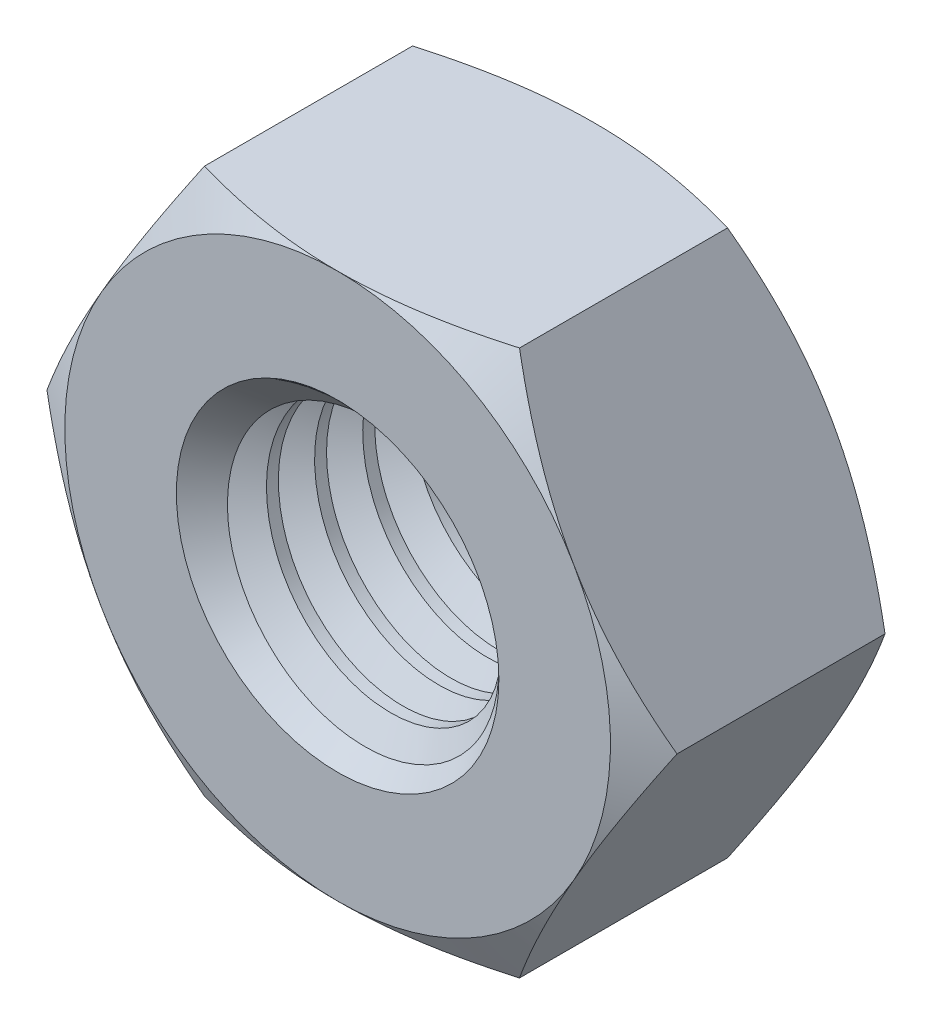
from build123d import *

# Parameters (mm, degrees)
Y_KSEKLIK_EKSTR_ZYON1_DEPTH = 8
IZIM2_OUTSIDE_W             = 54.778
IZIM2_OUTSIDE_H             = 52.148
IZIM2_OUTSIDE_R             = 8.5
KES_EKSTR_ZYON1_DEPTH       = 8
KES_EKSTR_ZYON1_DRAFT       = -60
IZIM3_OUTSIDE_W             = 54.778
IZIM3_OUTSIDE_H             = 52.148
IZIM3_OUTSIDE_R             = 8.5
KES_EKSTR_ZYON2_DEPTH       = 8
KES_EKSTR_ZYON2_DRAFT       = -60
IZIM4_R                     = 4.025
KES_EKSTR_ZYON3_DEPTH       = 28
PAH1_SIZE                   = 1
KES_S_P_R1_PITCH            = 1.5
KES_S_P_R1_HEIGHT           = 10
KES_S_P_R1_RADIUS           = 4.025


with BuildPart() as part:
    # izim1 → Y_kseklik-Ekstr_zyon1 (new body)
    with BuildSketch(Plane.XY):
        Polygon((9.814954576, 0), (4.907477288, 8.5), (-4.907477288, 8.5), (-9.814954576, 0), (-4.907477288, -8.5), (4.907477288, -8.5), align=None)
    extrude(amount=Y_KSEKLIK_EKSTR_ZYON1_DEPTH)


with BuildPart() as kes_ekstr_zyon1_tool:
    # izim2 outside → Kes-Ekstr_zyon1 (with draft: the straight prism first)
    with BuildSketch(Plane.XY.offset(8)):
        Rectangle(IZIM2_OUTSIDE_W, IZIM2_OUTSIDE_H)
        Circle(IZIM2_OUTSIDE_R, mode=Mode.SUBTRACT)
    extrude(amount=-KES_EKSTR_ZYON1_DEPTH)
    # Kes-Ekstr_zyon1: the draft: its side faces are tilted about the plane it starts from
    kes_ekstr_zyon1_sides = [kes_ekstr_zyon1_tool.faces().sort_by_distance(p)[0] for p in [
        (0, -26.074, 4),
        (27.389, 0, 4),
        (0, 26.074, 4),
        (-27.389, 0, 4),
        (-8.5, 0, 4),
    ]]
    draft(kes_ekstr_zyon1_sides, Plane.XY.offset(8), KES_EKSTR_ZYON1_DRAFT)


with BuildPart() as part_1:
    add(part.part)

    # Kes-Ekstr_zyon1: cut by kes_ekstr_zyon1_tool
    add(kes_ekstr_zyon1_tool.part, mode=Mode.SUBTRACT)


with BuildPart() as kes_ekstr_zyon2_tool:
    # izim3 outside → Kes-Ekstr_zyon2 (with draft: the straight prism first)
    with BuildSketch(Plane(origin=(0, 0, 0), x_dir=(-1, 0, 0), z_dir=(0, 0, -1))):
        Rectangle(IZIM3_OUTSIDE_W, IZIM3_OUTSIDE_H)
        Circle(IZIM3_OUTSIDE_R, mode=Mode.SUBTRACT)
    extrude(amount=-KES_EKSTR_ZYON2_DEPTH)
    # Kes-Ekstr_zyon2: the draft: its side faces are tilted about the plane it starts from
    kes_ekstr_zyon2_sides = [kes_ekstr_zyon2_tool.faces().sort_by_distance(p)[0] for p in [
        (0, -26.074, 4),
        (-27.389, 0, 4),
        (0, 26.074, 4),
        (27.389, 0, 4),
        (8.5, 0, 4),
    ]]
    draft(kes_ekstr_zyon2_sides, Plane(origin=(0, 0, 0), x_dir=(-1, 0, 0), z_dir=(0, 0, -1)), KES_EKSTR_ZYON2_DRAFT)


with BuildPart() as part_2:
    add(part_1.part)

    # Kes-Ekstr_zyon2: cut by kes_ekstr_zyon2_tool
    add(kes_ekstr_zyon2_tool.part, mode=Mode.SUBTRACT)

    # izim4 → Kes-Ekstr_zyon3 (cut)
    with BuildSketch(Plane(origin=(0, 0, 0), x_dir=(-1, 0, 0), z_dir=(0, 0, -1))):
        Circle(IZIM4_R)
    extrude(amount=-KES_EKSTR_ZYON3_DEPTH, mode=Mode.SUBTRACT)

    # Pah1
    pah1_edges = [part_2.edges().sort_by_distance(p)[0] for p in [
        (4.025, 0, 8),
        (4.025, 0, 0),
    ]]
    chamfer(pah1_edges, length=PAH1_SIZE)

    # Kes-S_p_r1: sweep along a helix
    with BuildLine() as kes_s_p_r1_path:
        Helix(KES_S_P_R1_PITCH, KES_S_P_R1_HEIGHT, KES_S_P_R1_RADIUS, center=(0, 0, 0), direction=(0, 0, 1))
    # izim6 → Kes-S_p_r1 (sweep, cut)
    with BuildSketch(Plane(origin=(-2.0125, -3.48575225, 10), x_dir=(0.05127593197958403, -0.0296041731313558, -0.9982456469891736), z_dir=(0.8645060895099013, -0.49912282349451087, 0.05920834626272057))):
        Polygon((0.741635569, 0.309550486), (-0.741635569, 0.309550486), (0, -0.975), align=None)
    sweep(path=kes_s_p_r1_path.line, is_frenet=True, mode=Mode.SUBTRACT)


solid = part_2.part
